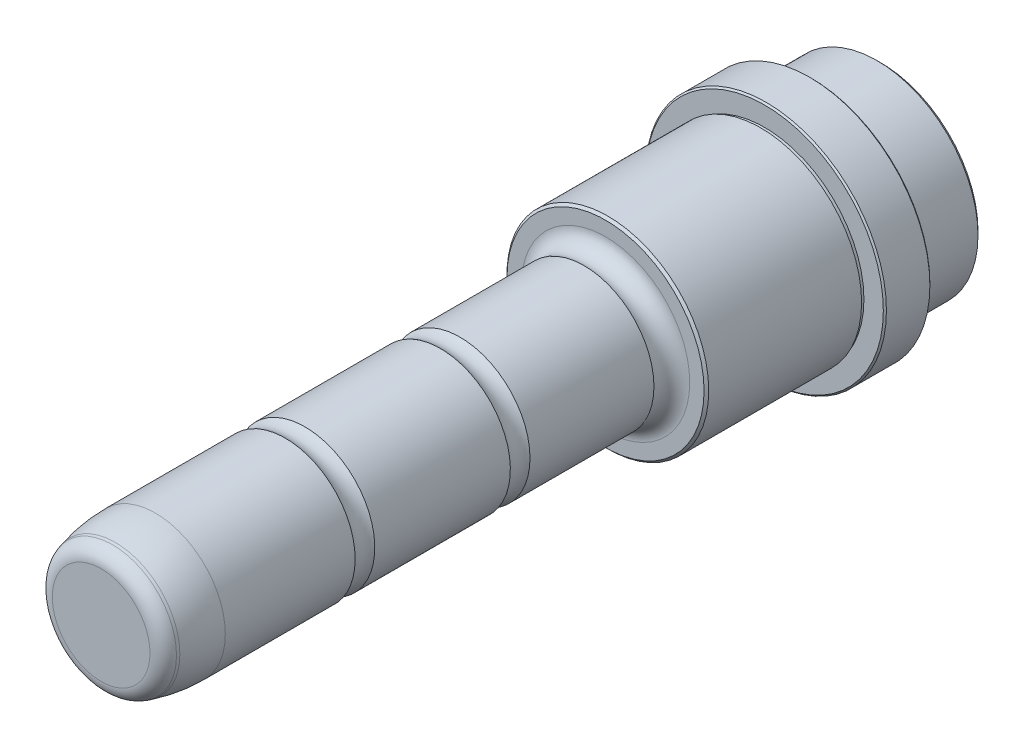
from build123d import *

# Parameters (mm, degrees)
LPATTERN1_COUNT = 2
LPATTERN1_PITCH = 20


with BuildPart() as part:
    # Sketch1 → Revolve1 (revolve)
    with BuildSketch(Plane(origin=(0, 0, 0), x_dir=(0, 0, -1), z_dir=(1, 0, 0)), mode=Mode.PRIVATE) as revolve1_sk:
        with BuildLine():
            Line((-26.75, 12.7), (-26.45, 13))
            Line((-26.45, 13), (-6.75, 13))
            Line((-6.75, 13), (-6.75, 12.8))
            Line((-6.75, 12.8), (-6.25, 12.8))
            Line((-6.25, 12.8), (-6.25, 15.3))
            Line((-6.25, 15.3), (-6.05, 15.5))
            Line((-6.05, 15.5), (-0.45, 15.5))
            Line((-0.45, 15.5), (-0.25, 15.3))
            Line((-0.25, 15.3), (-0.25, 12.8))
            Line((-0.25, 12.8), (0.25, 12.8))
            Line((0.25, 12.8), (0.25, 13))
            Line((0.25, 13), (8.25, 13))
            Line((8.25, 13), (8.75, 12.5))
            Line((8.75, 12.5), (8.75, 0))
            Line((8.75, 0), (-91.75, 0))
            Line((-91.75, 0), (-91.75, 6.295225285))
            ThreePointArc((-91.75, 6.295225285), (-91.336706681, 7.512748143), (-90.26763809, 8.227076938))
            Line((-90.26763809, 8.227076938), (-89.926380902, 8.318516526))
            ThreePointArc((-89.926380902, 8.318516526), (-87.360523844, 8.828897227), (-84.75, 9))
            Line((-84.75, 9), (-29.509934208, 9))
            ThreePointArc((-29.509934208, 9), (-27.636417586, 9.188695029), (-26.75, 10.85))
            Line((-26.75, 10.85), (-26.75, 12.7))
        make_face()
    revolve(revolve1_sk.sketch.rotate(Axis((0, 0, -8.75), (0, 0, -1)), 90), axis=Axis((0, 0, -8.75), (0, 0, -1)))

    # Sketch2 → Cut-Revolve1 (revolve, cut)
    with BuildSketch(Plane(origin=(0, 0, 0), x_dir=(0, 0, -1), z_dir=(1, 0, 0)), mode=Mode.PRIVATE) as cut_revolve1_sk:
        with BuildLine():
            Line((-68.014911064, 9), (-65.485088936, 9))
            ThreePointArc((-65.485088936, 9), (-66.75, 8.6), (-68.014911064, 9))
        make_face()
    cut_revolve1 = revolve(cut_revolve1_sk.sketch.rotate(Axis((0, 0, 91.75), (0, 0, -1)), 90), axis=Axis((0, 0, 91.75), (0, 0, -1)), mode=Mode.SUBTRACT)

    # LPattern1: Cut-Revolve1 ×2
    with Locations(*[(0, 0, -i * LPATTERN1_PITCH) for i in range(1, LPATTERN1_COUNT)]):
        add(cut_revolve1, mode=Mode.SUBTRACT)


solid = part.part
